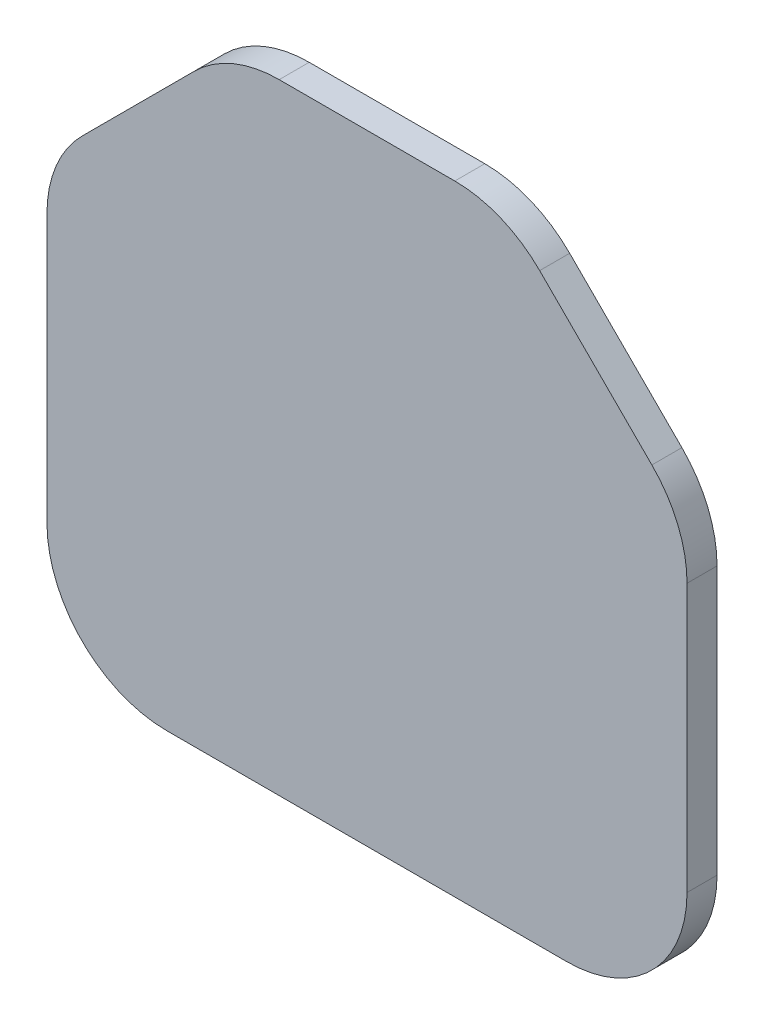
from build123d import *

# Parameters (mm, degrees)
BASE_EXTRUSION_DEPTH = 3


with BuildPart() as part:
    # Esquisse1 → Base-Extrusion (new body)
    with BuildSketch(Plane.XY):
        with BuildLine():
            Line((-32, 9.779437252), (-32, -17))
            ThreePointArc((-32, -17), (-28.485281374, -25.485281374), (-20, -29))
            Line((-20, -29), (20, -29))
            ThreePointArc((20, -29), (28.485281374, -25.485281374), (32, -17))
            Line((32, -17), (32, 9.779437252))
            ThreePointArc((32, 9.779437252), (31.08655439, 14.37163844), (28.485281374, 18.264718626))
            Line((28.485281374, 18.264718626), (17.264718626, 29.485281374))
            ThreePointArc((17.264718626, 29.485281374), (13.37163844, 32.08655439), (8.779437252, 33))
            Line((8.779437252, 33), (-8.779437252, 33))
            ThreePointArc((-8.779437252, 33), (-13.37163844, 32.08655439), (-17.264718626, 29.485281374))
            Line((-17.264718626, 29.485281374), (-28.485281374, 18.264718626))
            ThreePointArc((-28.485281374, 18.264718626), (-31.08655439, 14.37163844), (-32, 9.779437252))
        make_face()
    extrude(amount=BASE_EXTRUSION_DEPTH)


solid = part.part
